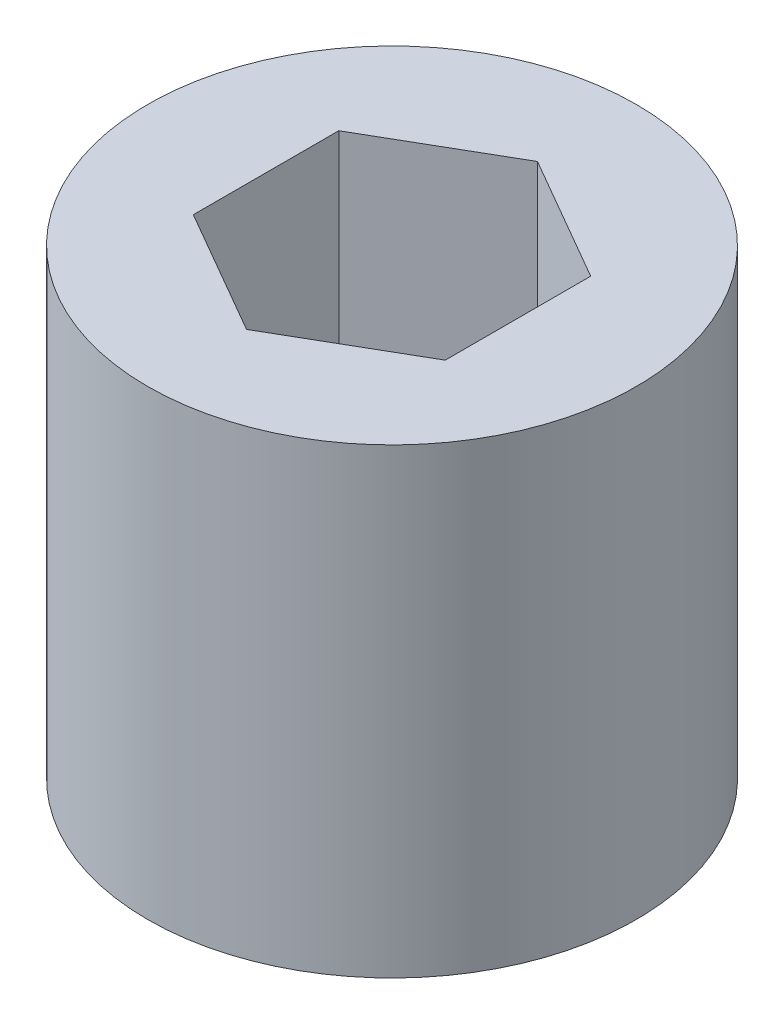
from build123d import *

# Parameters (mm, degrees)
SKETCH1_R           = 12.7
BOSS_EXTRUDE1_DEPTH = 24


with BuildPart() as part:
    # Sketch1 → Boss-Extrude1 (new body)
    with BuildSketch(Plane(origin=(0, 0, 0), x_dir=(1, 0, 0), z_dir=(0, 1, 0))):
        with Locations(Location((0, 0, 0), (0, 0, 270))):
            Circle(SKETCH1_R)
        Polygon((-6.5484375, -3.780742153), (0, -7.561484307), (6.5484375, -3.780742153), (6.5484375, 3.780742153), (0, 7.561484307), (-6.5484375, 3.780742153), align=None, mode=Mode.SUBTRACT)
    extrude(amount=BOSS_EXTRUDE1_DEPTH)


solid = part.part
